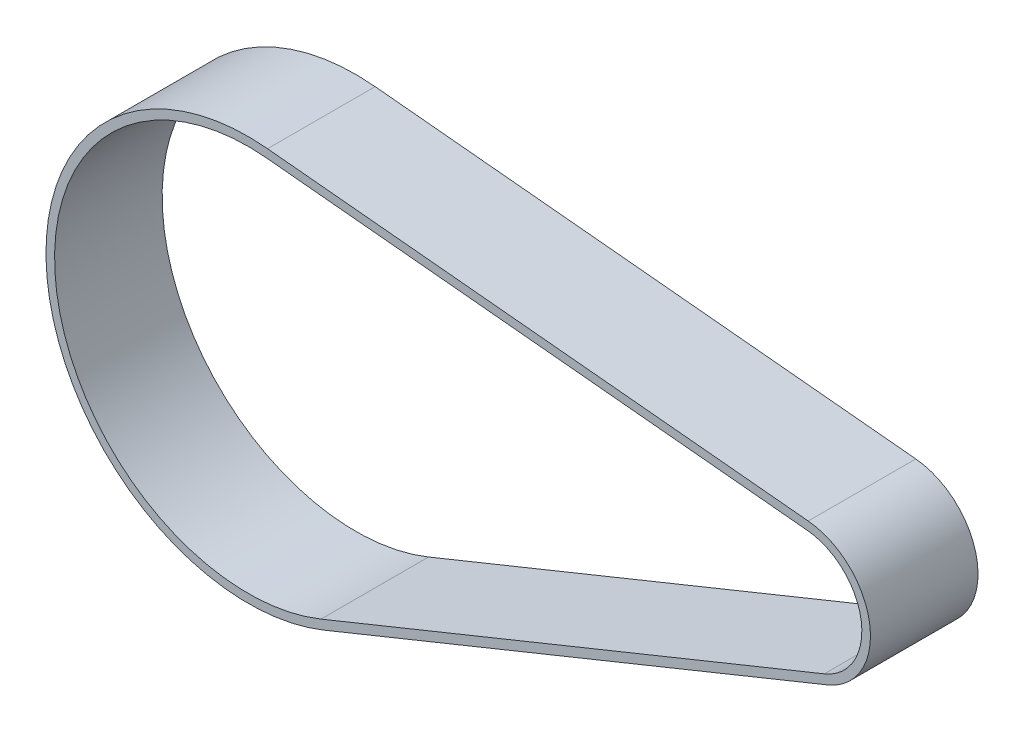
from build123d import *

# Parameters (mm, degrees)
EXTRU_MINCE1_DEPTH = 25


with BuildPart() as part:
    # Esquisse1 → Extru.-Mince1 (new body)
    with BuildSketch(Plane.XY):
        with BuildLine():
            Line((6.016432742, -14.825739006), (-110.96768474, -62.299060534))
            ThreePointArc((-110.96768474, -62.299060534), (-175.149609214, -25.526738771), (-124.133177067, 28.03487741))
            Line((-124.133177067, 28.03487741), (1.534563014, 15.926239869))
            ThreePointArc((1.534563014, 15.926239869), (15.832733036, 2.30750181), (6.016432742, -14.825739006))
        make_face()
        with BuildLine():
            Line((5.264378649, -12.97252163), (-111.719738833, -60.445843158))
            ThreePointArc((-111.719738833, -60.445843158), (-173.170517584, -25.238301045), (-124.324997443, 26.044097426))
            Line((-124.324997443, 26.044097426), (1.342742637, 13.935459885))
            ThreePointArc((1.342742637, 13.935459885), (13.853641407, 2.019064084), (5.264378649, -12.97252163))
        make_face(mode=Mode.SUBTRACT)
    extrude(amount=-EXTRU_MINCE1_DEPTH)


solid = part.part
